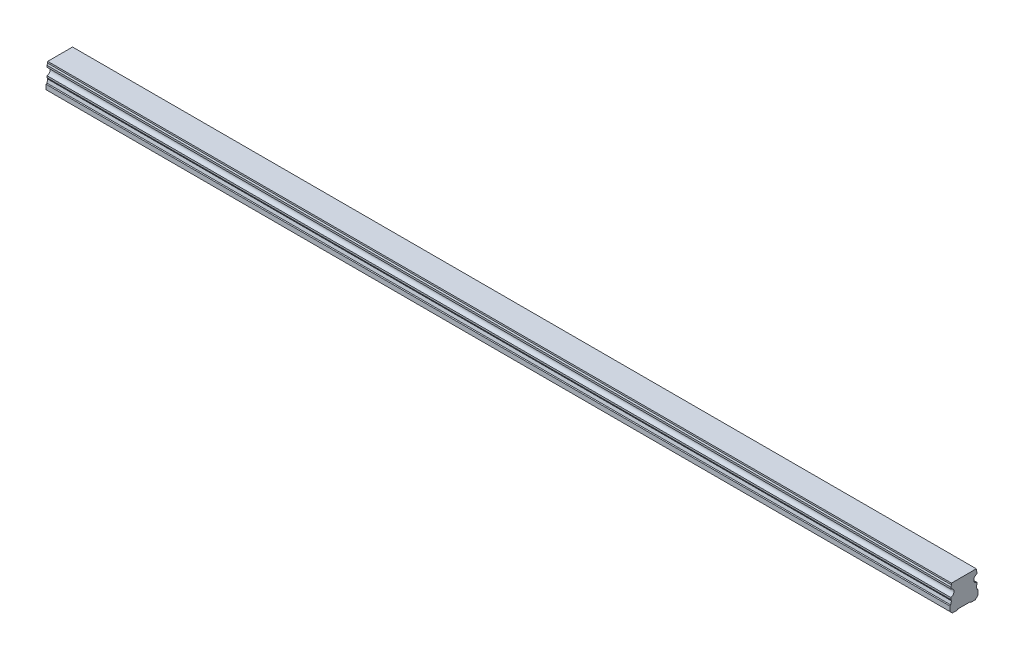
from build123d import *

# Parameters (mm, degrees)
BOSS_EXTRUDE1_DEPTH        = 480
SKETCH3_R                  = 2.5
SKETCH3_R_2                = 2.1
CUT_EXTRUDE3_DEPTH         = 7
SKETCH3_2_R                = 2.1
CUT_EXTRUDE4_DEPTH         = 9.5
CHAMFER1_SIZE              = 0.4
LPATTERN2_COUNT            = 8
LPATTERN2_PITCH            = 60
CHAMFER1_OF_LPATTERN2_SIZE = 0.4


with BuildPart() as part:
    # Sketch1 → Boss-Extrude1 (new body)
    with BuildSketch(Plane(origin=(0, 0, 0), x_dir=(0, 0, -1), z_dir=(1, 0, 0))):
        with BuildLine():
            Line((6.59, 14), (-6.59, 14))
            Line((-6.59, 14), (-6.59, 13.15))
            Line((-6.59, 13.15), (-6.96, 12.356532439))
            Line((-6.96, 12.356532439), (-6.96, 11.435174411))
            ThreePointArc((-6.96, 11.435174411), (-5.25, 9.5), (-6.96, 7.564825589))
            Line((-6.96, 7.564825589), (-6.96, 6.643467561))
            Line((-6.96, 6.643467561), (-6.59, 5.85))
            Line((-6.59, 5.85), (-7.032116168, 4.2))
            Line((-7.032116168, 4.2), (-7.5, 3.929867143))
            Line((-7.5, 3.929867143), (-7.5, 1.4))
            Line((-7.5, 1.4), (-6.1, 0))
            Line((-6.1, 0), (-3.65, 0))
            Line((-3.65, 0), (-3.25, 0.4))
            Line((-3.25, 0.4), (3.25, 0.4))
            Line((3.25, 0.4), (3.65, 0))
            Line((3.65, 0), (6.1, 0))
            Line((6.1, 0), (7.5, 1.4))
            Line((7.5, 1.4), (7.5, 3.929867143))
            Line((7.5, 3.929867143), (7.032116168, 4.2))
            Line((7.032116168, 4.2), (6.59, 5.85))
            Line((6.59, 5.85), (6.96, 6.643467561))
            Line((6.96, 6.643467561), (6.96, 7.564825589))
            ThreePointArc((6.96, 7.564825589), (5.25, 9.5), (6.96, 11.435174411))
            Line((6.96, 11.435174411), (6.96, 12.356532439))
            Line((6.96, 12.356532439), (6.59, 13.15))
            Line((6.59, 13.15), (6.59, 14))
        make_face()
    extrude(amount=BOSS_EXTRUDE1_DEPTH)

    # Sketch3 → Cut-Extrude3 (cut)
    with BuildSketch(Plane.XZ):
        with Locations(Location((30, 0, 0), (0, 0, 270))):
            Circle(SKETCH3_R)
        with Locations(Location((30, 0, 0), (0, 0, 270))):
            Circle(SKETCH3_R_2, mode=Mode.SUBTRACT)
    cut_extrude3 = extrude(amount=-CUT_EXTRUDE3_DEPTH, mode=Mode.SUBTRACT)

    # Sketch3_2 → Cut-Extrude4 (cut)
    with BuildSketch(Plane.XZ):
        with Locations(Location((30, 0, 0), (0, 0, 270))):
            Circle(SKETCH3_2_R)
    cut_extrude4 = extrude(amount=-CUT_EXTRUDE4_DEPTH, mode=Mode.SUBTRACT)

    # Cut-Extrude5 cone 1 section (on through the dimple's axis) → Cut-Extrude5 (revolve, cut)
    with BuildSketch(Plane(origin=(30, 9.5, 0), x_dir=(0, 0, -1), z_dir=(1, 0, 0))):
        Polygon((0, 0), (2.1, 0), (0, 1.212435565), align=None)
    revolve(axis=Axis((30, 9.5, 0), (0, 1, 0)), mode=Mode.SUBTRACT)

    # Chamfer1
    chamfer1_edges = [part.edges().sort_by_distance(p)[0] for p in [
        (30, 0.4, 2.5),
    ]]
    chamfer(chamfer1_edges, length=CHAMFER1_SIZE)

    # LPattern2: Cut-Extrude3, Cut-Extrude4 ×8
    with Locations(*[(i * LPATTERN2_PITCH, 0, 0) for i in range(1, LPATTERN2_COUNT)]):
        add(cut_extrude3, mode=Mode.SUBTRACT)
        add(cut_extrude4, mode=Mode.SUBTRACT)

    # Chamfer1 of LPattern2
    chamfer1_of_lpattern2_edges = [part.edges().sort_by_distance(p)[0] for p in [
        (90, 0.4, 2.5),
        (150, 0.4, 2.5),
        (210, 0.4, 2.5),
        (270, 0.4, 2.5),
        (330, 0.4, 2.5),
        (390, 0.4, 2.5),
        (450, 0.4, 2.5),
    ]]
    chamfer(chamfer1_of_lpattern2_edges, length=CHAMFER1_OF_LPATTERN2_SIZE)


solid = part.part
